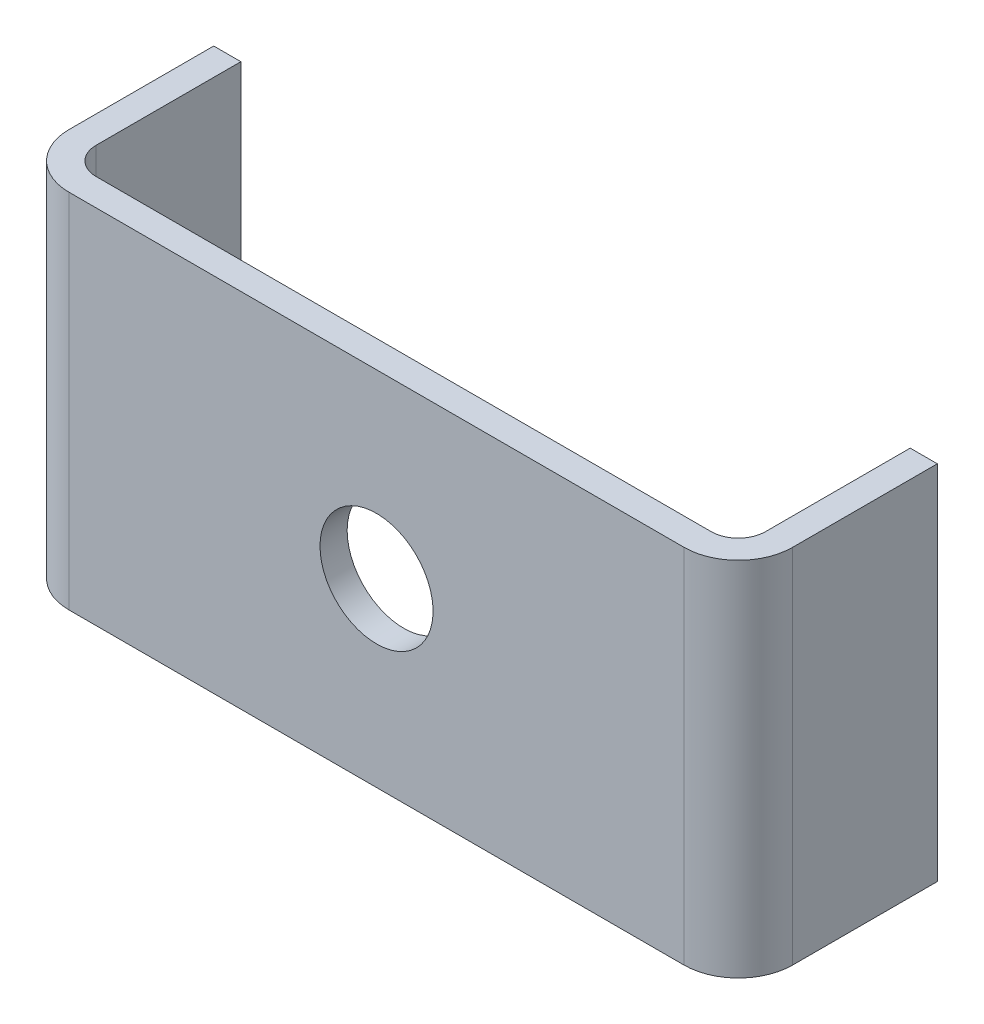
from build123d import *

# Parameters (mm, degrees)
ESQUISSE1_W                       = 80
ESQUISSE1_H                       = 40
BOSS_EXTRU_1_DEPTH                = 22
ESQUISSE2_W                       = 74
ESQUISSE2_H                       = 19
ENL_V_MAT_EXTRU_1_DEPTH           = 61.695963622
DIAM_TRE_DU_PER_AGE_12_5_12_5_1_D = 12.5
CONG_1_R                          = 3
CONG_2_R                          = 6


with BuildPart() as part:
    # Esquisse1 → Boss.-Extru.1 (new body)
    with BuildSketch(Plane(origin=(0, 0, -22), x_dir=(-1, 0, 0), z_dir=(0, 0, -1))):
        Rectangle(ESQUISSE1_W, ESQUISSE1_H)
    extrude(amount=-BOSS_EXTRU_1_DEPTH)

    # Esquisse2 → Enl_v. mat.-Extru.1 (cut, through all)
    with BuildSketch(Plane.XZ.offset(20)):
        with Locations((0, -12.5)):
            Rectangle(ESQUISSE2_W, ESQUISSE2_H)
    extrude(amount=-ENL_V_MAT_EXTRU_1_DEPTH, mode=Mode.SUBTRACT)

    # Diam_tre du per_age _12.5 _12.5_1 (through all)
    with Locations(Plane(origin=(0, 0, -3), x_dir=(-1, 0, 0), z_dir=(0, 0, -1))):
        with Locations((0, 0)):
            Hole(DIAM_TRE_DU_PER_AGE_12_5_12_5_1_D / 2)

    # Cong_1
    cong_1_edges = [part.edges().sort_by_distance(p)[0] for p in [
        (-37, 0, -3),
        (37, 0, -3),
    ]]
    fillet(cong_1_edges, radius=CONG_1_R)

    # Cong_2
    cong_2_edges = [part.edges().sort_by_distance(p)[0] for p in [
        (40, 0, 0),
        (-40, 0, 0),
    ]]
    fillet(cong_2_edges, radius=CONG_2_R)


solid = part.part
